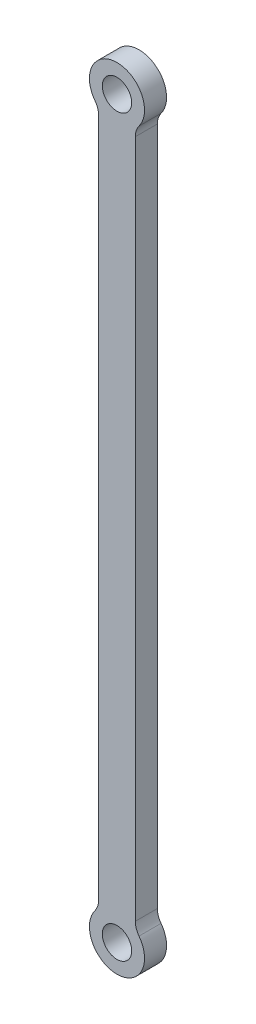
ISO-10303-21;
HEADER;
FILE_DESCRIPTION(('STEP AP214'),'2;1');
FILE_NAME('part.step','',(''),(''),'','','');
FILE_SCHEMA(('AUTOMOTIVE_DESIGN { 1 0 10303 214 1 1 1 1 }'));
ENDSEC;
DATA;
#1=APPLICATION_CONTEXT('core data for automotive mechanical design processes');
#2=APPLICATION_PROTOCOL_DEFINITION('international standard','automotive_design',2000,#1);
#3=PRODUCT_CONTEXT('',#1,'mechanical');
#4=PRODUCT('Part','Part','',(#3));
#5=PRODUCT_RELATED_PRODUCT_CATEGORY('part','',(#4));
#6=PRODUCT_DEFINITION_FORMATION('','',#4);
#7=PRODUCT_DEFINITION_CONTEXT('part definition',#1,'design');
#8=PRODUCT_DEFINITION('design','',#6,#7);
#9=PRODUCT_DEFINITION_SHAPE('','',#8);
#10=(LENGTH_UNIT() NAMED_UNIT(*) SI_UNIT(.MILLI.,.METRE.));
#11=(NAMED_UNIT(*) PLANE_ANGLE_UNIT() SI_UNIT($,.RADIAN.));
#12=(NAMED_UNIT(*) SI_UNIT($,.STERADIAN.) SOLID_ANGLE_UNIT());
#13=UNCERTAINTY_MEASURE_WITH_UNIT(LENGTH_MEASURE(1.E-05),#10,'distance_accuracy_value','');
#14=(GEOMETRIC_REPRESENTATION_CONTEXT(3) GLOBAL_UNCERTAINTY_ASSIGNED_CONTEXT((#13)) GLOBAL_UNIT_ASSIGNED_CONTEXT((#10,
#11,#12)) REPRESENTATION_CONTEXT('',''));
#15=CARTESIAN_POINT('',(0.,0.,0.));
#16=DIRECTION('',(0.,0.,1.));
#17=DIRECTION('',(1.,0.,0.));
#18=AXIS2_PLACEMENT_3D('',#15,#16,#17);
#19=CARTESIAN_POINT('',(10.,7.50000000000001,6.));
#20=DIRECTION('',(0.,0.,-1.));
#21=DIRECTION('',(-1.,0.,0.));
#22=AXIS2_PLACEMENT_3D('',#19,#20,#21);
#23=PLANE('',#22);
#24=CARTESIAN_POINT('',(10.,7.50000000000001,6.));
#25=DIRECTION('',(0.,0.,-1.));
#26=DIRECTION('',(-1.,0.,0.));
#27=AXIS2_PLACEMENT_3D('',#24,#25,#26);
#28=CIRCLE('',#27,5.);
#29=CARTESIAN_POINT('',(6.00000000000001,4.5,6.));
#30=VERTEX_POINT('',#29);
#31=CARTESIAN_POINT('',(5.,7.50000000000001,6.));
#32=VERTEX_POINT('',#31);
#33=EDGE_CURVE('E148',#30,#32,#28,.T.);
#34=ORIENTED_EDGE('',*,*,#33,.T.);
#35=DIRECTION('',(0.,1.,0.));
#36=VECTOR('',#35,1.);
#37=CARTESIAN_POINT('',(5.,7.50000000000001,6.));
#38=LINE('',#37,#36);
#39=CARTESIAN_POINT('',(5.,192.5,6.));
#40=VERTEX_POINT('',#39);
#41=EDGE_CURVE('E96',#32,#40,#38,.T.);
#42=ORIENTED_EDGE('',*,*,#41,.T.);
#43=CARTESIAN_POINT('',(10.,192.5,6.));
#44=DIRECTION('',(0.,0.,-1.));
#45=DIRECTION('',(-1.,0.,0.));
#46=AXIS2_PLACEMENT_3D('',#43,#44,#45);
#47=CIRCLE('',#46,5.);
#48=CARTESIAN_POINT('',(6.,195.5,6.));
#49=VERTEX_POINT('',#48);
#50=EDGE_CURVE('E163',#40,#49,#47,.T.);
#51=ORIENTED_EDGE('',*,*,#50,.T.);
#52=CARTESIAN_POINT('',(0.,200.,6.));
#53=DIRECTION('',(0.,0.,1.));
#54=DIRECTION('',(1.,0.,0.));
#55=AXIS2_PLACEMENT_3D('',#52,#53,#54);
#56=CIRCLE('',#55,7.5);
#57=CARTESIAN_POINT('',(-6.,195.5,6.));
#58=VERTEX_POINT('',#57);
#59=EDGE_CURVE('E176',#49,#58,#56,.T.);
#60=ORIENTED_EDGE('',*,*,#59,.T.);
#61=CARTESIAN_POINT('',(-10.,192.5,6.));
#62=DIRECTION('',(0.,0.,-1.));
#63=DIRECTION('',(1.,0.,0.));
#64=AXIS2_PLACEMENT_3D('',#61,#62,#63);
#65=CIRCLE('',#64,5.);
#66=CARTESIAN_POINT('',(-5.,192.5,6.));
#67=VERTEX_POINT('',#66);
#68=EDGE_CURVE('E115',#58,#67,#65,.T.);
#69=ORIENTED_EDGE('',*,*,#68,.T.);
#70=DIRECTION('',(0.,-1.,0.));
#71=VECTOR('',#70,1.);
#72=CARTESIAN_POINT('',(-5.,7.50000000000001,6.));
#73=LINE('',#72,#71);
#74=CARTESIAN_POINT('',(-5.,7.50000000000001,6.));
#75=VERTEX_POINT('',#74);
#76=EDGE_CURVE('E109',#67,#75,#73,.T.);
#77=ORIENTED_EDGE('',*,*,#76,.T.);
#78=CARTESIAN_POINT('',(-10.,7.50000000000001,6.));
#79=DIRECTION('',(0.,0.,-1.));
#80=DIRECTION('',(1.,0.,0.));
#81=AXIS2_PLACEMENT_3D('',#78,#79,#80);
#82=CIRCLE('',#81,5.);
#83=CARTESIAN_POINT('',(-6.00000000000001,4.5,6.));
#84=VERTEX_POINT('',#83);
#85=EDGE_CURVE('E113',#75,#84,#82,.T.);
#86=ORIENTED_EDGE('',*,*,#85,.T.);
#87=CARTESIAN_POINT('',(0.,0.,6.));
#88=DIRECTION('',(0.,0.,1.));
#89=DIRECTION('',(1.,0.,0.));
#90=AXIS2_PLACEMENT_3D('',#87,#88,#89);
#91=CIRCLE('',#90,7.50000000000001);
#92=EDGE_CURVE('E53',#84,#30,#91,.T.);
#93=ORIENTED_EDGE('',*,*,#92,.T.);
#94=EDGE_LOOP('',(#34,#42,#51,#60,#69,#77,#86,#93));
#95=FACE_BOUND('',#94,.T.);
#96=CARTESIAN_POINT('',(0.,0.,6.));
#97=DIRECTION('',(0.,0.,1.));
#98=DIRECTION('',(1.,0.,0.));
#99=AXIS2_PLACEMENT_3D('',#96,#97,#98);
#100=CIRCLE('',#99,4.);
#101=CARTESIAN_POINT('',(4.,0.,6.));
#102=VERTEX_POINT('',#101);
#103=EDGE_CURVE('E137',#102,#102,#100,.T.);
#104=ORIENTED_EDGE('',*,*,#103,.F.);
#105=EDGE_LOOP('',(#104));
#106=FACE_BOUND('',#105,.T.);
#107=CARTESIAN_POINT('',(0.,200.,6.));
#108=DIRECTION('',(0.,0.,1.));
#109=DIRECTION('',(1.,0.,0.));
#110=AXIS2_PLACEMENT_3D('',#107,#108,#109);
#111=CIRCLE('',#110,4.);
#112=CARTESIAN_POINT('',(4.,200.,6.));
#113=VERTEX_POINT('',#112);
#114=EDGE_CURVE('E185',#113,#113,#111,.T.);
#115=ORIENTED_EDGE('',*,*,#114,.F.);
#116=EDGE_LOOP('',(#115));
#117=FACE_BOUND('',#116,.T.);
#118=ADVANCED_FACE('F36',(#95,#106,#117),#23,.F.);
#119=CARTESIAN_POINT('',(10.,7.50000000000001,0.));
#120=DIRECTION('',(0.,0.,-1.));
#121=DIRECTION('',(-1.,0.,0.));
#122=AXIS2_PLACEMENT_3D('',#119,#120,#121);
#123=PLANE('',#122);
#124=CARTESIAN_POINT('',(0.,0.,0.));
#125=DIRECTION('',(0.,0.,1.));
#126=DIRECTION('',(1.,0.,0.));
#127=AXIS2_PLACEMENT_3D('',#124,#125,#126);
#128=CIRCLE('',#127,4.);
#129=CARTESIAN_POINT('',(4.,0.,0.));
#130=VERTEX_POINT('',#129);
#131=EDGE_CURVE('E182',#130,#130,#128,.T.);
#132=ORIENTED_EDGE('',*,*,#131,.T.);
#133=EDGE_LOOP('',(#132));
#134=FACE_BOUND('',#133,.T.);
#135=CARTESIAN_POINT('',(10.,7.50000000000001,0.));
#136=DIRECTION('',(0.,0.,-1.));
#137=DIRECTION('',(-1.,0.,0.));
#138=AXIS2_PLACEMENT_3D('',#135,#136,#137);
#139=CIRCLE('',#138,5.);
#140=CARTESIAN_POINT('',(6.00000000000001,4.5,0.));
#141=VERTEX_POINT('',#140);
#142=CARTESIAN_POINT('',(5.,7.50000000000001,0.));
#143=VERTEX_POINT('',#142);
#144=EDGE_CURVE('E133',#141,#143,#139,.T.);
#145=ORIENTED_EDGE('',*,*,#144,.F.);
#146=CARTESIAN_POINT('',(0.,0.,0.));
#147=DIRECTION('',(0.,0.,1.));
#148=DIRECTION('',(1.,0.,0.));
#149=AXIS2_PLACEMENT_3D('',#146,#147,#148);
#150=CIRCLE('',#149,7.50000000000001);
#151=CARTESIAN_POINT('',(-6.00000000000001,4.5,0.));
#152=VERTEX_POINT('',#151);
#153=EDGE_CURVE('E88',#152,#141,#150,.T.);
#154=ORIENTED_EDGE('',*,*,#153,.F.);
#155=CARTESIAN_POINT('',(-10.,7.50000000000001,0.));
#156=DIRECTION('',(0.,0.,-1.));
#157=DIRECTION('',(1.,0.,0.));
#158=AXIS2_PLACEMENT_3D('',#155,#156,#157);
#159=CIRCLE('',#158,5.);
#160=CARTESIAN_POINT('',(-5.,7.50000000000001,0.));
#161=VERTEX_POINT('',#160);
#162=EDGE_CURVE('E82',#161,#152,#159,.T.);
#163=ORIENTED_EDGE('',*,*,#162,.F.);
#164=DIRECTION('',(0.,-1.,0.));
#165=VECTOR('',#164,1.);
#166=CARTESIAN_POINT('',(-5.,7.50000000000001,0.));
#167=LINE('',#166,#165);
#168=CARTESIAN_POINT('',(-5.,192.5,0.));
#169=VERTEX_POINT('',#168);
#170=EDGE_CURVE('E123',#169,#161,#167,.T.);
#171=ORIENTED_EDGE('',*,*,#170,.F.);
#172=CARTESIAN_POINT('',(-10.,192.5,0.));
#173=DIRECTION('',(0.,0.,-1.));
#174=DIRECTION('',(1.,0.,0.));
#175=AXIS2_PLACEMENT_3D('',#172,#173,#174);
#176=CIRCLE('',#175,5.);
#177=CARTESIAN_POINT('',(-6.,195.5,0.));
#178=VERTEX_POINT('',#177);
#179=EDGE_CURVE('E143',#178,#169,#176,.T.);
#180=ORIENTED_EDGE('',*,*,#179,.F.);
#181=CARTESIAN_POINT('',(0.,200.,0.));
#182=DIRECTION('',(0.,0.,1.));
#183=DIRECTION('',(1.,0.,0.));
#184=AXIS2_PLACEMENT_3D('',#181,#182,#183);
#185=CIRCLE('',#184,7.5);
#186=CARTESIAN_POINT('',(6.,195.5,0.));
#187=VERTEX_POINT('',#186);
#188=EDGE_CURVE('E141',#187,#178,#185,.T.);
#189=ORIENTED_EDGE('',*,*,#188,.F.);
#190=CARTESIAN_POINT('',(10.,192.5,0.));
#191=DIRECTION('',(0.,0.,-1.));
#192=DIRECTION('',(-1.,0.,0.));
#193=AXIS2_PLACEMENT_3D('',#190,#191,#192);
#194=CIRCLE('',#193,5.);
#195=CARTESIAN_POINT('',(5.,192.5,0.));
#196=VERTEX_POINT('',#195);
#197=EDGE_CURVE('E139',#196,#187,#194,.T.);
#198=ORIENTED_EDGE('',*,*,#197,.F.);
#199=DIRECTION('',(0.,1.,0.));
#200=VECTOR('',#199,1.);
#201=CARTESIAN_POINT('',(5.,7.50000000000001,0.));
#202=LINE('',#201,#200);
#203=EDGE_CURVE('E136',#143,#196,#202,.T.);
#204=ORIENTED_EDGE('',*,*,#203,.F.);
#205=EDGE_LOOP('',(#145,#154,#163,#171,#180,#189,#198,#204));
#206=FACE_BOUND('',#205,.T.);
#207=CARTESIAN_POINT('',(0.,200.,0.));
#208=DIRECTION('',(0.,0.,1.));
#209=DIRECTION('',(1.,0.,0.));
#210=AXIS2_PLACEMENT_3D('',#207,#208,#209);
#211=CIRCLE('',#210,4.);
#212=CARTESIAN_POINT('',(4.,200.,0.));
#213=VERTEX_POINT('',#212);
#214=EDGE_CURVE('E188',#213,#213,#211,.T.);
#215=ORIENTED_EDGE('',*,*,#214,.T.);
#216=EDGE_LOOP('',(#215));
#217=FACE_BOUND('',#216,.T.);
#218=ADVANCED_FACE('F167',(#134,#206,#217),#123,.T.);
#219=CARTESIAN_POINT('',(10.,7.50000000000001,6.));
#220=DIRECTION('',(0.,0.,-1.));
#221=DIRECTION('',(-1.,0.,0.));
#222=AXIS2_PLACEMENT_3D('',#219,#220,#221);
#223=CYLINDRICAL_SURFACE('',#222,5.);
#224=ORIENTED_EDGE('',*,*,#144,.T.);
#225=DIRECTION('',(0.,0.,-1.));
#226=VECTOR('',#225,1.);
#227=CARTESIAN_POINT('',(5.,7.50000000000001,6.));
#228=LINE('',#227,#226);
#229=EDGE_CURVE('E11',#32,#143,#228,.T.);
#230=ORIENTED_EDGE('',*,*,#229,.F.);
#231=ORIENTED_EDGE('',*,*,#33,.F.);
#232=DIRECTION('',(0.,0.,-1.));
#233=VECTOR('',#232,1.);
#234=CARTESIAN_POINT('',(6.00000000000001,4.5,6.));
#235=LINE('',#234,#233);
#236=EDGE_CURVE('E129',#30,#141,#235,.T.);
#237=ORIENTED_EDGE('',*,*,#236,.T.);
#238=EDGE_LOOP('',(#224,#230,#231,#237));
#239=FACE_BOUND('',#238,.T.);
#240=ADVANCED_FACE('F38',(#239),#223,.F.);
#241=CARTESIAN_POINT('',(5.,7.50000000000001,6.));
#242=DIRECTION('',(-1.,0.,0.));
#243=DIRECTION('',(0.,-1.,0.));
#244=AXIS2_PLACEMENT_3D('',#241,#242,#243);
#245=PLANE('',#244);
#246=ORIENTED_EDGE('',*,*,#203,.T.);
#247=DIRECTION('',(0.,0.,-1.));
#248=VECTOR('',#247,1.);
#249=CARTESIAN_POINT('',(5.,192.5,6.));
#250=LINE('',#249,#248);
#251=EDGE_CURVE('E45',#40,#196,#250,.T.);
#252=ORIENTED_EDGE('',*,*,#251,.F.);
#253=ORIENTED_EDGE('',*,*,#41,.F.);
#254=ORIENTED_EDGE('',*,*,#229,.T.);
#255=EDGE_LOOP('',(#246,#252,#253,#254));
#256=FACE_BOUND('',#255,.T.);
#257=ADVANCED_FACE('F220',(#256),#245,.F.);
#258=CARTESIAN_POINT('',(10.,192.5,6.));
#259=DIRECTION('',(0.,0.,-1.));
#260=DIRECTION('',(-1.,0.,0.));
#261=AXIS2_PLACEMENT_3D('',#258,#259,#260);
#262=CYLINDRICAL_SURFACE('',#261,5.);
#263=ORIENTED_EDGE('',*,*,#197,.T.);
#264=DIRECTION('',(0.,0.,-1.));
#265=VECTOR('',#264,1.);
#266=CARTESIAN_POINT('',(6.,195.5,6.));
#267=LINE('',#266,#265);
#268=EDGE_CURVE('E155',#49,#187,#267,.T.);
#269=ORIENTED_EDGE('',*,*,#268,.F.);
#270=ORIENTED_EDGE('',*,*,#50,.F.);
#271=ORIENTED_EDGE('',*,*,#251,.T.);
#272=EDGE_LOOP('',(#263,#269,#270,#271));
#273=FACE_BOUND('',#272,.T.);
#274=ADVANCED_FACE('F161',(#273),#262,.F.);
#275=CARTESIAN_POINT('',(0.,200.,6.));
#276=DIRECTION('',(0.,0.,-1.));
#277=DIRECTION('',(-1.,0.,0.));
#278=AXIS2_PLACEMENT_3D('',#275,#276,#277);
#279=CYLINDRICAL_SURFACE('',#278,7.5);
#280=ORIENTED_EDGE('',*,*,#188,.T.);
#281=DIRECTION('',(0.,0.,-1.));
#282=VECTOR('',#281,1.);
#283=CARTESIAN_POINT('',(-6.,195.5,6.));
#284=LINE('',#283,#282);
#285=EDGE_CURVE('E152',#58,#178,#284,.T.);
#286=ORIENTED_EDGE('',*,*,#285,.F.);
#287=ORIENTED_EDGE('',*,*,#59,.F.);
#288=ORIENTED_EDGE('',*,*,#268,.T.);
#289=EDGE_LOOP('',(#280,#286,#287,#288));
#290=FACE_BOUND('',#289,.T.);
#291=ADVANCED_FACE('F172',(#290),#279,.T.);
#292=CARTESIAN_POINT('',(-10.,192.5,6.));
#293=DIRECTION('',(0.,0.,-1.));
#294=DIRECTION('',(-1.,0.,0.));
#295=AXIS2_PLACEMENT_3D('',#292,#293,#294);
#296=CYLINDRICAL_SURFACE('',#295,5.);
#297=ORIENTED_EDGE('',*,*,#179,.T.);
#298=DIRECTION('',(0.,0.,-1.));
#299=VECTOR('',#298,1.);
#300=CARTESIAN_POINT('',(-5.,192.5,6.));
#301=LINE('',#300,#299);
#302=EDGE_CURVE('E124',#67,#169,#301,.T.);
#303=ORIENTED_EDGE('',*,*,#302,.F.);
#304=ORIENTED_EDGE('',*,*,#68,.F.);
#305=ORIENTED_EDGE('',*,*,#285,.T.);
#306=EDGE_LOOP('',(#297,#303,#304,#305));
#307=FACE_BOUND('',#306,.T.);
#308=ADVANCED_FACE('F175',(#307),#296,.F.);
#309=CARTESIAN_POINT('',(-5.,7.50000000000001,6.));
#310=DIRECTION('',(1.,0.,0.));
#311=DIRECTION('',(0.,1.,0.));
#312=AXIS2_PLACEMENT_3D('',#309,#310,#311);
#313=PLANE('',#312);
#314=ORIENTED_EDGE('',*,*,#170,.T.);
#315=DIRECTION('',(0.,0.,-1.));
#316=VECTOR('',#315,1.);
#317=CARTESIAN_POINT('',(-5.,7.50000000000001,6.));
#318=LINE('',#317,#316);
#319=EDGE_CURVE('E120',#75,#161,#318,.T.);
#320=ORIENTED_EDGE('',*,*,#319,.F.);
#321=ORIENTED_EDGE('',*,*,#76,.F.);
#322=ORIENTED_EDGE('',*,*,#302,.T.);
#323=EDGE_LOOP('',(#314,#320,#321,#322));
#324=FACE_BOUND('',#323,.T.);
#325=ADVANCED_FACE('F121',(#324),#313,.F.);
#326=CARTESIAN_POINT('',(-10.,7.50000000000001,6.));
#327=DIRECTION('',(0.,0.,-1.));
#328=DIRECTION('',(-1.,0.,0.));
#329=AXIS2_PLACEMENT_3D('',#326,#327,#328);
#330=CYLINDRICAL_SURFACE('',#329,5.);
#331=ORIENTED_EDGE('',*,*,#162,.T.);
#332=DIRECTION('',(0.,0.,-1.));
#333=VECTOR('',#332,1.);
#334=CARTESIAN_POINT('',(-6.00000000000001,4.5,6.));
#335=LINE('',#334,#333);
#336=EDGE_CURVE('E125',#84,#152,#335,.T.);
#337=ORIENTED_EDGE('',*,*,#336,.F.);
#338=ORIENTED_EDGE('',*,*,#85,.F.);
#339=ORIENTED_EDGE('',*,*,#319,.T.);
#340=EDGE_LOOP('',(#331,#337,#338,#339));
#341=FACE_BOUND('',#340,.T.);
#342=ADVANCED_FACE('F127',(#341),#330,.F.);
#343=CARTESIAN_POINT('',(0.,0.,6.));
#344=DIRECTION('',(0.,0.,-1.));
#345=DIRECTION('',(-1.,0.,0.));
#346=AXIS2_PLACEMENT_3D('',#343,#344,#345);
#347=CYLINDRICAL_SURFACE('',#346,7.50000000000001);
#348=ORIENTED_EDGE('',*,*,#153,.T.);
#349=ORIENTED_EDGE('',*,*,#236,.F.);
#350=ORIENTED_EDGE('',*,*,#92,.F.);
#351=ORIENTED_EDGE('',*,*,#336,.T.);
#352=EDGE_LOOP('',(#348,#349,#350,#351));
#353=FACE_BOUND('',#352,.T.);
#354=ADVANCED_FACE('F208',(#353),#347,.T.);
#355=CARTESIAN_POINT('',(0.,0.,6.));
#356=DIRECTION('',(0.,0.,-1.));
#357=DIRECTION('',(-1.,0.,0.));
#358=AXIS2_PLACEMENT_3D('',#355,#356,#357);
#359=CYLINDRICAL_SURFACE('',#358,4.);
#360=ORIENTED_EDGE('',*,*,#103,.T.);
#361=EDGE_LOOP('',(#360));
#362=FACE_BOUND('',#361,.T.);
#363=ORIENTED_EDGE('',*,*,#131,.F.);
#364=EDGE_LOOP('',(#363));
#365=FACE_BOUND('',#364,.T.);
#366=ADVANCED_FACE('F205',(#362,#365),#359,.F.);
#367=CARTESIAN_POINT('',(0.,200.,6.));
#368=DIRECTION('',(0.,0.,-1.));
#369=DIRECTION('',(-1.,0.,0.));
#370=AXIS2_PLACEMENT_3D('',#367,#368,#369);
#371=CYLINDRICAL_SURFACE('',#370,4.);
#372=ORIENTED_EDGE('',*,*,#114,.T.);
#373=EDGE_LOOP('',(#372));
#374=FACE_BOUND('',#373,.T.);
#375=ORIENTED_EDGE('',*,*,#214,.F.);
#376=EDGE_LOOP('',(#375));
#377=FACE_BOUND('',#376,.T.);
#378=ADVANCED_FACE('F194',(#374,#377),#371,.F.);
#379=CLOSED_SHELL('',(#118,#218,#240,#257,#274,#291,#308,#325,#342,#354,#366,#378));
#380=MANIFOLD_SOLID_BREP('B2',#379);
#381=ADVANCED_BREP_SHAPE_REPRESENTATION('',(#18,#380),#14);
#382=SHAPE_DEFINITION_REPRESENTATION(#9,#381);
ENDSEC;
END-ISO-10303-21;
